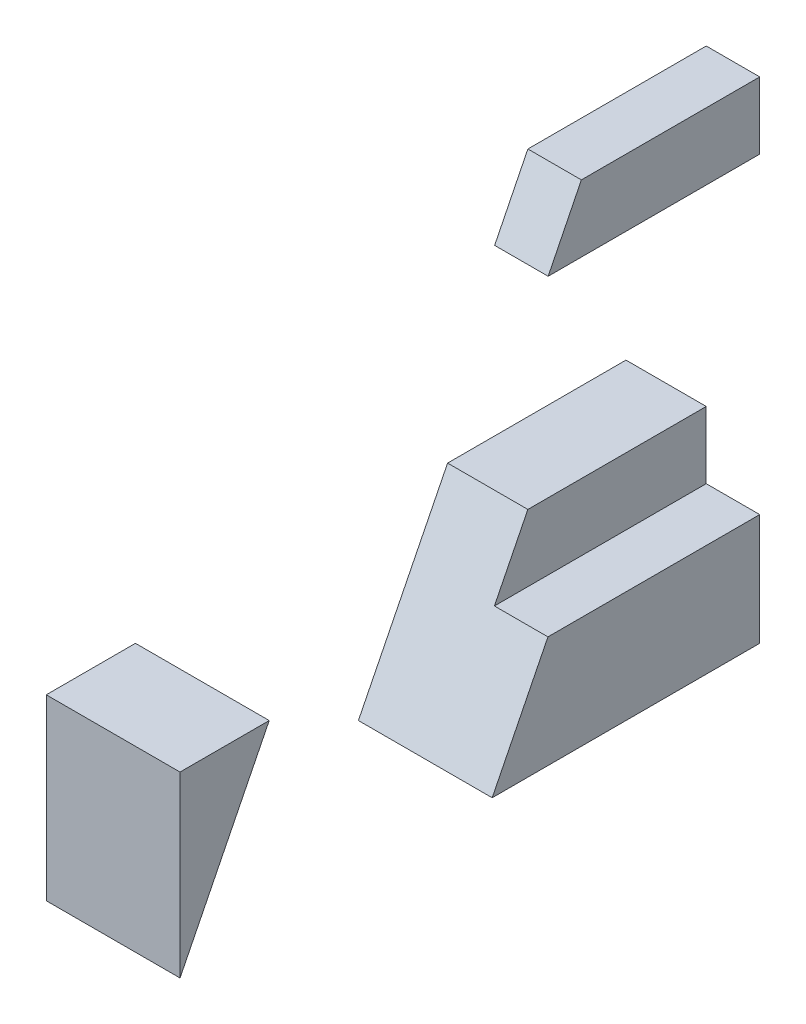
ISO-10303-21;
HEADER;
FILE_DESCRIPTION(('STEP AP214'),'2;1');
FILE_NAME('part.step','',(''),(''),'','','');
FILE_SCHEMA(('AUTOMOTIVE_DESIGN { 1 0 10303 214 1 1 1 1 }'));
ENDSEC;
DATA;
#1=APPLICATION_CONTEXT('core data for automotive mechanical design processes');
#2=APPLICATION_PROTOCOL_DEFINITION('international standard','automotive_design',2000,#1);
#3=PRODUCT_CONTEXT('',#1,'mechanical');
#4=PRODUCT('Part','Part','',(#3));
#5=PRODUCT_RELATED_PRODUCT_CATEGORY('part','',(#4));
#6=PRODUCT_DEFINITION_FORMATION('','',#4);
#7=PRODUCT_DEFINITION_CONTEXT('part definition',#1,'design');
#8=PRODUCT_DEFINITION('design','',#6,#7);
#9=PRODUCT_DEFINITION_SHAPE('','',#8);
#10=(LENGTH_UNIT() NAMED_UNIT(*) SI_UNIT(.MILLI.,.METRE.));
#11=(NAMED_UNIT(*) PLANE_ANGLE_UNIT() SI_UNIT($,.RADIAN.));
#12=(NAMED_UNIT(*) SI_UNIT($,.STERADIAN.) SOLID_ANGLE_UNIT());
#13=UNCERTAINTY_MEASURE_WITH_UNIT(LENGTH_MEASURE(1.E-05),#10,'distance_accuracy_value','');
#14=(GEOMETRIC_REPRESENTATION_CONTEXT(3) GLOBAL_UNCERTAINTY_ASSIGNED_CONTEXT((#13)) GLOBAL_UNIT_ASSIGNED_CONTEXT((#10,
#11,#12)) REPRESENTATION_CONTEXT('',''));
#15=CARTESIAN_POINT('',(0.,0.,0.));
#16=DIRECTION('',(0.,0.,1.));
#17=DIRECTION('',(1.,0.,0.));
#18=AXIS2_PLACEMENT_3D('',#15,#16,#17);
#19=CARTESIAN_POINT('',(3.,110.,100.001));
#20=DIRECTION('',(-1.,0.,0.));
#21=DIRECTION('',(0.,-1.,0.));
#22=AXIS2_PLACEMENT_3D('',#19,#20,#21);
#23=PLANE('',#22);
#24=DIRECTION('',(0.,-0.89565760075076,0.444744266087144));
#25=VECTOR('',#24,1.);
#26=CARTESIAN_POINT('',(2.99999999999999,74.1491292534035,27.8019693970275));
#27=LINE('',#26,#25);
#28=CARTESIAN_POINT('',(3.,110.,10.));
#29=VERTEX_POINT('',#28);
#30=CARTESIAN_POINT('',(3.,95.,17.4483418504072));
#31=VERTEX_POINT('',#30);
#32=EDGE_CURVE('E56',#29,#31,#27,.T.);
#33=ORIENTED_EDGE('',*,*,#32,.F.);
#34=DIRECTION('',(0.,0.,-1.));
#35=VECTOR('',#34,1.);
#36=CARTESIAN_POINT('',(3.,110.,100.001));
#37=LINE('',#36,#35);
#38=CARTESIAN_POINT('',(3.,110.,-30.));
#39=VERTEX_POINT('',#38);
#40=EDGE_CURVE('E64',#29,#39,#37,.T.);
#41=ORIENTED_EDGE('',*,*,#40,.T.);
#42=DIRECTION('',(0.,1.,0.));
#43=VECTOR('',#42,1.);
#44=CARTESIAN_POINT('',(3.,110.,-30.));
#45=LINE('',#44,#43);
#46=CARTESIAN_POINT('',(3.,95.,-30.));
#47=VERTEX_POINT('',#46);
#48=EDGE_CURVE('E103',#47,#39,#45,.T.);
#49=ORIENTED_EDGE('',*,*,#48,.F.);
#50=DIRECTION('',(0.,0.,-1.));
#51=VECTOR('',#50,1.);
#52=CARTESIAN_POINT('',(3.,95.,100.001));
#53=LINE('',#52,#51);
#54=EDGE_CURVE('E102',#31,#47,#53,.T.);
#55=ORIENTED_EDGE('',*,*,#54,.F.);
#56=EDGE_LOOP('',(#33,#41,#49,#55));
#57=FACE_BOUND('',#56,.T.);
#58=ADVANCED_FACE('F42',(#57),#23,.T.);
#59=CARTESIAN_POINT('',(3.,95.,100.001));
#60=DIRECTION('',(0.,-1.,0.));
#61=DIRECTION('',(0.,0.,-1.));
#62=AXIS2_PLACEMENT_3D('',#59,#60,#61);
#63=PLANE('',#62);
#64=DIRECTION('',(1.,0.,0.));
#65=VECTOR('',#64,1.);
#66=CARTESIAN_POINT('',(3.,95.,17.4483418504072));
#67=LINE('',#66,#65);
#68=CARTESIAN_POINT('',(15.,95.,17.4483418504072));
#69=VERTEX_POINT('',#68);
#70=EDGE_CURVE('E93',#31,#69,#67,.T.);
#71=ORIENTED_EDGE('',*,*,#70,.F.);
#72=ORIENTED_EDGE('',*,*,#54,.T.);
#73=DIRECTION('',(-1.,0.,0.));
#74=VECTOR('',#73,1.);
#75=CARTESIAN_POINT('',(3.,95.,-30.));
#76=LINE('',#75,#74);
#77=CARTESIAN_POINT('',(15.,95.,-30.));
#78=VERTEX_POINT('',#77);
#79=EDGE_CURVE('E101',#78,#47,#76,.T.);
#80=ORIENTED_EDGE('',*,*,#79,.F.);
#81=DIRECTION('',(0.,0.,-1.));
#82=VECTOR('',#81,1.);
#83=CARTESIAN_POINT('',(15.,95.,100.001));
#84=LINE('',#83,#82);
#85=EDGE_CURVE('E87',#69,#78,#84,.T.);
#86=ORIENTED_EDGE('',*,*,#85,.F.);
#87=EDGE_LOOP('',(#71,#72,#80,#86));
#88=FACE_BOUND('',#87,.T.);
#89=ADVANCED_FACE('F100',(#88),#63,.T.);
#90=CARTESIAN_POINT('',(15.,110.,10.));
#91=DIRECTION('',(0.,-1.,0.));
#92=DIRECTION('',(0.,0.,-1.));
#93=AXIS2_PLACEMENT_3D('',#90,#91,#92);
#94=PLANE('',#93);
#95=ORIENTED_EDGE('',*,*,#40,.F.);
#96=DIRECTION('',(-1.,0.,0.));
#97=VECTOR('',#96,1.);
#98=CARTESIAN_POINT('',(15.,110.,10.));
#99=LINE('',#98,#97);
#100=CARTESIAN_POINT('',(15.,110.,10.));
#101=VERTEX_POINT('',#100);
#102=EDGE_CURVE('E12',#101,#29,#99,.T.);
#103=ORIENTED_EDGE('',*,*,#102,.F.);
#104=DIRECTION('',(0.,0.,1.));
#105=VECTOR('',#104,1.);
#106=CARTESIAN_POINT('',(15.,110.,10.));
#107=LINE('',#106,#105);
#108=CARTESIAN_POINT('',(15.,110.,-30.));
#109=VERTEX_POINT('',#108);
#110=EDGE_CURVE('E90',#109,#101,#107,.T.);
#111=ORIENTED_EDGE('',*,*,#110,.F.);
#112=DIRECTION('',(-1.,0.,0.));
#113=VECTOR('',#112,1.);
#114=CARTESIAN_POINT('',(15.,110.,-30.));
#115=LINE('',#114,#113);
#116=EDGE_CURVE('E50',#109,#39,#115,.T.);
#117=ORIENTED_EDGE('',*,*,#116,.T.);
#118=EDGE_LOOP('',(#95,#103,#111,#117));
#119=FACE_BOUND('',#118,.T.);
#120=ADVANCED_FACE('F44',(#119),#94,.F.);
#121=CARTESIAN_POINT('',(15.,110.,10.));
#122=DIRECTION('',(0.,-0.444744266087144,-0.89565760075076));
#123=DIRECTION('',(0.,0.89565760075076,-0.444744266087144));
#124=AXIS2_PLACEMENT_3D('',#121,#122,#123);
#125=PLANE('',#124);
#126=ORIENTED_EDGE('',*,*,#32,.T.);
#127=ORIENTED_EDGE('',*,*,#70,.T.);
#128=DIRECTION('',(0.,-0.89565760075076,0.444744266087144));
#129=VECTOR('',#128,1.);
#130=CARTESIAN_POINT('',(15.,110.,10.));
#131=LINE('',#130,#129);
#132=EDGE_CURVE('E84',#101,#69,#131,.T.);
#133=ORIENTED_EDGE('',*,*,#132,.F.);
#134=ORIENTED_EDGE('',*,*,#102,.T.);
#135=EDGE_LOOP('',(#126,#127,#133,#134));
#136=FACE_BOUND('',#135,.T.);
#137=ADVANCED_FACE('F94',(#136),#125,.F.);
#138=CARTESIAN_POINT('',(15.,110.,-30.));
#139=DIRECTION('',(0.,0.,1.));
#140=DIRECTION('',(1.,0.,0.));
#141=AXIS2_PLACEMENT_3D('',#138,#139,#140);
#142=PLANE('',#141);
#143=ORIENTED_EDGE('',*,*,#48,.T.);
#144=ORIENTED_EDGE('',*,*,#116,.F.);
#145=DIRECTION('',(0.,1.,0.));
#146=VECTOR('',#145,1.);
#147=CARTESIAN_POINT('',(15.,110.,-30.));
#148=LINE('',#147,#146);
#149=EDGE_CURVE('E91',#78,#109,#148,.T.);
#150=ORIENTED_EDGE('',*,*,#149,.F.);
#151=ORIENTED_EDGE('',*,*,#79,.T.);
#152=EDGE_LOOP('',(#143,#144,#150,#151));
#153=FACE_BOUND('',#152,.T.);
#154=ADVANCED_FACE('F116',(#153),#142,.F.);
#155=CARTESIAN_POINT('',(15.,110.,-30.));
#156=DIRECTION('',(-1.,0.,0.));
#157=DIRECTION('',(0.,0.,1.));
#158=AXIS2_PLACEMENT_3D('',#155,#156,#157);
#159=PLANE('',#158);
#160=ORIENTED_EDGE('',*,*,#85,.T.);
#161=ORIENTED_EDGE('',*,*,#149,.T.);
#162=ORIENTED_EDGE('',*,*,#110,.T.);
#163=ORIENTED_EDGE('',*,*,#132,.T.);
#164=EDGE_LOOP('',(#160,#161,#162,#163));
#165=FACE_BOUND('',#164,.T.);
#166=ADVANCED_FACE('F85',(#165),#159,.F.);
#167=CLOSED_SHELL('',(#58,#89,#120,#137,#154,#166));
#168=MANIFOLD_SOLID_BREP('B2',#167);
#169=CARTESIAN_POINT('',(15.,0.,100.));
#170=DIRECTION('',(0.,0.,-1.));
#171=DIRECTION('',(-1.,0.,0.));
#172=AXIS2_PLACEMENT_3D('',#169,#170,#171);
#173=PLANE('',#172);
#174=DIRECTION('',(0.,-1.,0.));
#175=VECTOR('',#174,1.);
#176=CARTESIAN_POINT('',(-15.,0.,100.));
#177=LINE('',#176,#175);
#178=CARTESIAN_POINT('',(-15.,40.,100.));
#179=VERTEX_POINT('',#178);
#180=CARTESIAN_POINT('',(-15.,0.,100.));
#181=VERTEX_POINT('',#180);
#182=EDGE_CURVE('E222',#179,#181,#177,.T.);
#183=ORIENTED_EDGE('',*,*,#182,.T.);
#184=DIRECTION('',(-1.,0.,0.));
#185=VECTOR('',#184,1.);
#186=CARTESIAN_POINT('',(15.,0.,100.));
#187=LINE('',#186,#185);
#188=CARTESIAN_POINT('',(15.,0.,100.));
#189=VERTEX_POINT('',#188);
#190=EDGE_CURVE('E40',#189,#181,#187,.T.);
#191=ORIENTED_EDGE('',*,*,#190,.F.);
#192=DIRECTION('',(0.,-1.,0.));
#193=VECTOR('',#192,1.);
#194=CARTESIAN_POINT('',(15.,0.,100.));
#195=LINE('',#194,#193);
#196=CARTESIAN_POINT('',(15.,40.,100.));
#197=VERTEX_POINT('',#196);
#198=EDGE_CURVE('E215',#197,#189,#195,.T.);
#199=ORIENTED_EDGE('',*,*,#198,.F.);
#200=DIRECTION('',(-1.,0.,0.));
#201=VECTOR('',#200,1.);
#202=CARTESIAN_POINT('',(15.,40.,100.));
#203=LINE('',#202,#201);
#204=EDGE_CURVE('E223',#197,#179,#203,.T.);
#205=ORIENTED_EDGE('',*,*,#204,.T.);
#206=EDGE_LOOP('',(#183,#191,#199,#205));
#207=FACE_BOUND('',#206,.T.);
#208=ADVANCED_FACE('F175',(#207),#173,.F.);
#209=CARTESIAN_POINT('',(15.,40.,80.));
#210=DIRECTION('',(0.,0.447213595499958,0.894427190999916));
#211=DIRECTION('',(0.,-0.894427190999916,0.447213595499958));
#212=AXIS2_PLACEMENT_3D('',#209,#210,#211);
#213=PLANE('',#212);
#214=DIRECTION('',(0.,0.894427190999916,-0.447213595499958));
#215=VECTOR('',#214,1.);
#216=CARTESIAN_POINT('',(-15.,40.,80.));
#217=LINE('',#216,#215);
#218=CARTESIAN_POINT('',(-15.,40.,80.));
#219=VERTEX_POINT('',#218);
#220=EDGE_CURVE('E203',#181,#219,#217,.T.);
#221=ORIENTED_EDGE('',*,*,#220,.T.);
#222=DIRECTION('',(-1.,0.,0.));
#223=VECTOR('',#222,1.);
#224=CARTESIAN_POINT('',(15.,40.,80.));
#225=LINE('',#224,#223);
#226=CARTESIAN_POINT('',(15.,40.,80.));
#227=VERTEX_POINT('',#226);
#228=EDGE_CURVE('E183',#227,#219,#225,.T.);
#229=ORIENTED_EDGE('',*,*,#228,.F.);
#230=DIRECTION('',(0.,0.894427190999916,-0.447213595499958));
#231=VECTOR('',#230,1.);
#232=CARTESIAN_POINT('',(15.,40.,80.));
#233=LINE('',#232,#231);
#234=EDGE_CURVE('E211',#189,#227,#233,.T.);
#235=ORIENTED_EDGE('',*,*,#234,.F.);
#236=ORIENTED_EDGE('',*,*,#190,.T.);
#237=EDGE_LOOP('',(#221,#229,#235,#236));
#238=FACE_BOUND('',#237,.T.);
#239=ADVANCED_FACE('F212',(#238),#213,.F.);
#240=CARTESIAN_POINT('',(15.,40.,100.));
#241=DIRECTION('',(0.,-1.,0.));
#242=DIRECTION('',(0.,0.,-1.));
#243=AXIS2_PLACEMENT_3D('',#240,#241,#242);
#244=PLANE('',#243);
#245=DIRECTION('',(0.,0.,1.));
#246=VECTOR('',#245,1.);
#247=CARTESIAN_POINT('',(-15.,40.,100.));
#248=LINE('',#247,#246);
#249=EDGE_CURVE('E208',#219,#179,#248,.T.);
#250=ORIENTED_EDGE('',*,*,#249,.T.);
#251=ORIENTED_EDGE('',*,*,#204,.F.);
#252=DIRECTION('',(0.,0.,1.));
#253=VECTOR('',#252,1.);
#254=CARTESIAN_POINT('',(15.,40.,100.));
#255=LINE('',#254,#253);
#256=EDGE_CURVE('E191',#227,#197,#255,.T.);
#257=ORIENTED_EDGE('',*,*,#256,.F.);
#258=ORIENTED_EDGE('',*,*,#228,.T.);
#259=EDGE_LOOP('',(#250,#251,#257,#258));
#260=FACE_BOUND('',#259,.T.);
#261=ADVANCED_FACE('F230',(#260),#244,.F.);
#262=CARTESIAN_POINT('',(15.,40.,100.));
#263=DIRECTION('',(-1.,0.,0.));
#264=DIRECTION('',(0.,0.,1.));
#265=AXIS2_PLACEMENT_3D('',#262,#263,#264);
#266=PLANE('',#265);
#267=ORIENTED_EDGE('',*,*,#198,.T.);
#268=ORIENTED_EDGE('',*,*,#234,.T.);
#269=ORIENTED_EDGE('',*,*,#256,.T.);
#270=EDGE_LOOP('',(#267,#268,#269));
#271=FACE_BOUND('',#270,.T.);
#272=ADVANCED_FACE('F218',(#271),#266,.F.);
#273=CARTESIAN_POINT('',(-15.,40.,100.));
#274=DIRECTION('',(-1.,0.,0.));
#275=DIRECTION('',(0.,0.,1.));
#276=AXIS2_PLACEMENT_3D('',#273,#274,#275);
#277=PLANE('',#276);
#278=ORIENTED_EDGE('',*,*,#182,.F.);
#279=ORIENTED_EDGE('',*,*,#249,.F.);
#280=ORIENTED_EDGE('',*,*,#220,.F.);
#281=EDGE_LOOP('',(#278,#279,#280));
#282=FACE_BOUND('',#281,.T.);
#283=ADVANCED_FACE('F231',(#282),#277,.T.);
#284=CLOSED_SHELL('',(#208,#239,#261,#272,#283));
#285=MANIFOLD_SOLID_BREP('B6',#284);
#286=CARTESIAN_POINT('',(15.,40.,30.));
#287=DIRECTION('',(-1.,0.,0.));
#288=DIRECTION('',(0.,0.,1.));
#289=AXIS2_PLACEMENT_3D('',#286,#287,#288);
#290=PLANE('',#289);
#291=DIRECTION('',(0.,-1.,0.));
#292=VECTOR('',#291,1.);
#293=CARTESIAN_POINT('',(15.,40.,-30.));
#294=LINE('',#293,#292);
#295=CARTESIAN_POINT('',(15.,25.,-30.));
#296=VERTEX_POINT('',#295);
#297=CARTESIAN_POINT('',(15.,0.,-30.));
#298=VERTEX_POINT('',#297);
#299=EDGE_CURVE('E318',#296,#298,#294,.T.);
#300=ORIENTED_EDGE('',*,*,#299,.F.);
#301=DIRECTION('',(0.,0.,-1.));
#302=VECTOR('',#301,1.);
#303=CARTESIAN_POINT('',(15.,25.,20.));
#304=LINE('',#303,#302);
#305=CARTESIAN_POINT('',(15.,25.,17.5));
#306=VERTEX_POINT('',#305);
#307=EDGE_CURVE('E354',#306,#296,#304,.T.);
#308=ORIENTED_EDGE('',*,*,#307,.F.);
#309=DIRECTION('',(0.,0.894427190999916,-0.447213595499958));
#310=VECTOR('',#309,1.);
#311=CARTESIAN_POINT('',(15.,40.,10.));
#312=LINE('',#311,#310);
#313=CARTESIAN_POINT('',(15.,0.,30.));
#314=VERTEX_POINT('',#313);
#315=EDGE_CURVE('E349',#314,#306,#312,.T.);
#316=ORIENTED_EDGE('',*,*,#315,.F.);
#317=DIRECTION('',(0.,0.,-1.));
#318=VECTOR('',#317,1.);
#319=CARTESIAN_POINT('',(15.,0.,30.));
#320=LINE('',#319,#318);
#321=EDGE_CURVE('E324',#314,#298,#320,.T.);
#322=ORIENTED_EDGE('',*,*,#321,.T.);
#323=EDGE_LOOP('',(#300,#308,#316,#322));
#324=FACE_BOUND('',#323,.T.);
#325=ADVANCED_FACE('F273',(#324),#290,.F.);
#326=CARTESIAN_POINT('',(-15.,40.,-30.));
#327=DIRECTION('',(0.,0.,1.));
#328=DIRECTION('',(1.,0.,0.));
#329=AXIS2_PLACEMENT_3D('',#326,#327,#328);
#330=PLANE('',#329);
#331=DIRECTION('',(-1.,0.,0.));
#332=VECTOR('',#331,1.);
#333=CARTESIAN_POINT('',(-15.,40.,-30.));
#334=LINE('',#333,#332);
#335=CARTESIAN_POINT('',(3.,40.,-30.));
#336=VERTEX_POINT('',#335);
#337=CARTESIAN_POINT('',(-15.,40.,-30.));
#338=VERTEX_POINT('',#337);
#339=EDGE_CURVE('E296',#336,#338,#334,.T.);
#340=ORIENTED_EDGE('',*,*,#339,.F.);
#341=DIRECTION('',(0.,1.,0.));
#342=VECTOR('',#341,1.);
#343=CARTESIAN_POINT('',(3.,40.,-30.));
#344=LINE('',#343,#342);
#345=CARTESIAN_POINT('',(3.,25.,-30.));
#346=VERTEX_POINT('',#345);
#347=EDGE_CURVE('E358',#346,#336,#344,.T.);
#348=ORIENTED_EDGE('',*,*,#347,.F.);
#349=DIRECTION('',(-1.,0.,0.));
#350=VECTOR('',#349,1.);
#351=CARTESIAN_POINT('',(3.,25.,-30.));
#352=LINE('',#351,#350);
#353=EDGE_CURVE('E363',#296,#346,#352,.T.);
#354=ORIENTED_EDGE('',*,*,#353,.F.);
#355=ORIENTED_EDGE('',*,*,#299,.T.);
#356=DIRECTION('',(-1.,0.,0.));
#357=VECTOR('',#356,1.);
#358=CARTESIAN_POINT('',(-15.,0.,-30.));
#359=LINE('',#358,#357);
#360=CARTESIAN_POINT('',(-15.,0.,-30.));
#361=VERTEX_POINT('',#360);
#362=EDGE_CURVE('E311',#298,#361,#359,.T.);
#363=ORIENTED_EDGE('',*,*,#362,.T.);
#364=DIRECTION('',(0.,-1.,0.));
#365=VECTOR('',#364,1.);
#366=CARTESIAN_POINT('',(-15.,40.,-30.));
#367=LINE('',#366,#365);
#368=EDGE_CURVE('E314',#338,#361,#367,.T.);
#369=ORIENTED_EDGE('',*,*,#368,.F.);
#370=EDGE_LOOP('',(#340,#348,#354,#355,#363,#369));
#371=FACE_BOUND('',#370,.T.);
#372=ADVANCED_FACE('F313',(#371),#330,.F.);
#373=CARTESIAN_POINT('',(-15.,40.,30.));
#374=DIRECTION('',(1.,0.,0.));
#375=DIRECTION('',(0.,0.,-1.));
#376=AXIS2_PLACEMENT_3D('',#373,#374,#375);
#377=PLANE('',#376);
#378=DIRECTION('',(0.,0.,1.));
#379=VECTOR('',#378,1.);
#380=CARTESIAN_POINT('',(-15.,0.,30.));
#381=LINE('',#380,#379);
#382=CARTESIAN_POINT('',(-15.,0.,30.));
#383=VERTEX_POINT('',#382);
#384=EDGE_CURVE('E323',#361,#383,#381,.T.);
#385=ORIENTED_EDGE('',*,*,#384,.T.);
#386=DIRECTION('',(0.,0.894427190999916,-0.447213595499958));
#387=VECTOR('',#386,1.);
#388=CARTESIAN_POINT('',(-15.,40.,10.));
#389=LINE('',#388,#387);
#390=CARTESIAN_POINT('',(-15.,40.,10.));
#391=VERTEX_POINT('',#390);
#392=EDGE_CURVE('E367',#383,#391,#389,.T.);
#393=ORIENTED_EDGE('',*,*,#392,.T.);
#394=DIRECTION('',(0.,0.,1.));
#395=VECTOR('',#394,1.);
#396=CARTESIAN_POINT('',(-15.,40.,30.));
#397=LINE('',#396,#395);
#398=EDGE_CURVE('E331',#338,#391,#397,.T.);
#399=ORIENTED_EDGE('',*,*,#398,.F.);
#400=ORIENTED_EDGE('',*,*,#368,.T.);
#401=EDGE_LOOP('',(#385,#393,#399,#400));
#402=FACE_BOUND('',#401,.T.);
#403=ADVANCED_FACE('F328',(#402),#377,.F.);
#404=CARTESIAN_POINT('',(15.,40.,-30.));
#405=DIRECTION('',(0.,-1.,0.));
#406=DIRECTION('',(0.,0.,-1.));
#407=AXIS2_PLACEMENT_3D('',#404,#405,#406);
#408=PLANE('',#407);
#409=DIRECTION('',(1.,0.,0.));
#410=VECTOR('',#409,1.);
#411=CARTESIAN_POINT('',(-15.,40.,10.));
#412=LINE('',#411,#410);
#413=CARTESIAN_POINT('',(3.,40.,10.));
#414=VERTEX_POINT('',#413);
#415=EDGE_CURVE('E369',#391,#414,#412,.T.);
#416=ORIENTED_EDGE('',*,*,#415,.T.);
#417=DIRECTION('',(0.,0.,-1.));
#418=VECTOR('',#417,1.);
#419=CARTESIAN_POINT('',(3.,40.,20.));
#420=LINE('',#419,#418);
#421=EDGE_CURVE('E360',#414,#336,#420,.T.);
#422=ORIENTED_EDGE('',*,*,#421,.T.);
#423=ORIENTED_EDGE('',*,*,#339,.T.);
#424=ORIENTED_EDGE('',*,*,#398,.T.);
#425=EDGE_LOOP('',(#416,#422,#423,#424));
#426=FACE_BOUND('',#425,.T.);
#427=ADVANCED_FACE('F383',(#426),#408,.F.);
#428=CARTESIAN_POINT('',(15.,0.,-30.));
#429=DIRECTION('',(0.,-1.,0.));
#430=DIRECTION('',(0.,0.,-1.));
#431=AXIS2_PLACEMENT_3D('',#428,#429,#430);
#432=PLANE('',#431);
#433=ORIENTED_EDGE('',*,*,#321,.F.);
#434=DIRECTION('',(1.,0.,0.));
#435=VECTOR('',#434,1.);
#436=CARTESIAN_POINT('',(-15.,0.,30.));
#437=LINE('',#436,#435);
#438=EDGE_CURVE('E335',#383,#314,#437,.T.);
#439=ORIENTED_EDGE('',*,*,#438,.F.);
#440=ORIENTED_EDGE('',*,*,#384,.F.);
#441=ORIENTED_EDGE('',*,*,#362,.F.);
#442=EDGE_LOOP('',(#433,#439,#440,#441));
#443=FACE_BOUND('',#442,.T.);
#444=ADVANCED_FACE('F333',(#443),#432,.T.);
#445=CARTESIAN_POINT('',(-15.,40.,10.));
#446=DIRECTION('',(0.,-0.447213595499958,-0.894427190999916));
#447=DIRECTION('',(0.,0.894427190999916,-0.447213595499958));
#448=AXIS2_PLACEMENT_3D('',#445,#446,#447);
#449=PLANE('',#448);
#450=DIRECTION('',(-1.,0.,0.));
#451=VECTOR('',#450,1.);
#452=CARTESIAN_POINT('',(-15.,25.,17.5));
#453=LINE('',#452,#451);
#454=CARTESIAN_POINT('',(3.,25.,17.5));
#455=VERTEX_POINT('',#454);
#456=EDGE_CURVE('E280',#306,#455,#453,.T.);
#457=ORIENTED_EDGE('',*,*,#456,.T.);
#458=DIRECTION('',(0.,0.894427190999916,-0.447213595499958));
#459=VECTOR('',#458,1.);
#460=CARTESIAN_POINT('',(3.,40.,10.));
#461=LINE('',#460,#459);
#462=EDGE_CURVE('E173',#455,#414,#461,.T.);
#463=ORIENTED_EDGE('',*,*,#462,.T.);
#464=ORIENTED_EDGE('',*,*,#415,.F.);
#465=ORIENTED_EDGE('',*,*,#392,.F.);
#466=ORIENTED_EDGE('',*,*,#438,.T.);
#467=ORIENTED_EDGE('',*,*,#315,.T.);
#468=EDGE_LOOP('',(#457,#463,#464,#465,#466,#467));
#469=FACE_BOUND('',#468,.T.);
#470=ADVANCED_FACE('F343',(#469),#449,.F.);
#471=CARTESIAN_POINT('',(3.,40.,20.));
#472=DIRECTION('',(-1.,0.,0.));
#473=DIRECTION('',(0.,-1.,0.));
#474=AXIS2_PLACEMENT_3D('',#471,#472,#473);
#475=PLANE('',#474);
#476=DIRECTION('',(0.,0.,-1.));
#477=VECTOR('',#476,1.);
#478=CARTESIAN_POINT('',(3.,25.,20.));
#479=LINE('',#478,#477);
#480=EDGE_CURVE('E287',#455,#346,#479,.T.);
#481=ORIENTED_EDGE('',*,*,#480,.T.);
#482=ORIENTED_EDGE('',*,*,#347,.T.);
#483=ORIENTED_EDGE('',*,*,#421,.F.);
#484=ORIENTED_EDGE('',*,*,#462,.F.);
#485=EDGE_LOOP('',(#481,#482,#483,#484));
#486=FACE_BOUND('',#485,.T.);
#487=ADVANCED_FACE('F380',(#486),#475,.F.);
#488=CARTESIAN_POINT('',(3.,25.,20.));
#489=DIRECTION('',(0.,-1.,0.));
#490=DIRECTION('',(0.,0.,-1.));
#491=AXIS2_PLACEMENT_3D('',#488,#489,#490);
#492=PLANE('',#491);
#493=ORIENTED_EDGE('',*,*,#307,.T.);
#494=ORIENTED_EDGE('',*,*,#353,.T.);
#495=ORIENTED_EDGE('',*,*,#480,.F.);
#496=ORIENTED_EDGE('',*,*,#456,.F.);
#497=EDGE_LOOP('',(#493,#494,#495,#496));
#498=FACE_BOUND('',#497,.T.);
#499=ADVANCED_FACE('F352',(#498),#492,.F.);
#500=CLOSED_SHELL('',(#325,#372,#403,#427,#444,#470,#487,#499));
#501=MANIFOLD_SOLID_BREP('B34',#500);
#502=ADVANCED_BREP_SHAPE_REPRESENTATION('',(#18,#168,#285,#501),#14);
#503=SHAPE_DEFINITION_REPRESENTATION(#9,#502);
ENDSEC;
END-ISO-10303-21;
